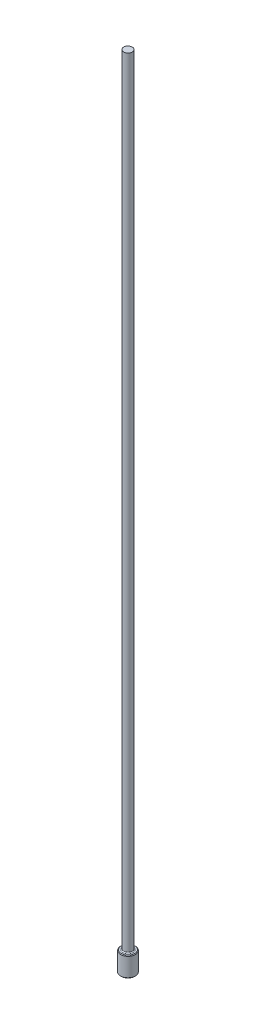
ISO-10303-21;
HEADER;
FILE_DESCRIPTION(('STEP AP214'),'2;1');
FILE_NAME('part.step','',(''),(''),'','','');
FILE_SCHEMA(('AUTOMOTIVE_DESIGN { 1 0 10303 214 1 1 1 1 }'));
ENDSEC;
DATA;
#1=APPLICATION_CONTEXT('core data for automotive mechanical design processes');
#2=APPLICATION_PROTOCOL_DEFINITION('international standard','automotive_design',2000,#1);
#3=PRODUCT_CONTEXT('',#1,'mechanical');
#4=PRODUCT('Part','Part','',(#3));
#5=PRODUCT_RELATED_PRODUCT_CATEGORY('part','',(#4));
#6=PRODUCT_DEFINITION_FORMATION('','',#4);
#7=PRODUCT_DEFINITION_CONTEXT('part definition',#1,'design');
#8=PRODUCT_DEFINITION('design','',#6,#7);
#9=PRODUCT_DEFINITION_SHAPE('','',#8);
#10=(LENGTH_UNIT() NAMED_UNIT(*) SI_UNIT(.MILLI.,.METRE.));
#11=(NAMED_UNIT(*) PLANE_ANGLE_UNIT() SI_UNIT($,.RADIAN.));
#12=(NAMED_UNIT(*) SI_UNIT($,.STERADIAN.) SOLID_ANGLE_UNIT());
#13=UNCERTAINTY_MEASURE_WITH_UNIT(LENGTH_MEASURE(1.E-05),#10,'distance_accuracy_value','');
#14=(GEOMETRIC_REPRESENTATION_CONTEXT(3) GLOBAL_UNCERTAINTY_ASSIGNED_CONTEXT((#13)) GLOBAL_UNIT_ASSIGNED_CONTEXT((#10,
#11,#12)) REPRESENTATION_CONTEXT('',''));
#15=CARTESIAN_POINT('',(0.,0.,0.));
#16=DIRECTION('',(0.,0.,1.));
#17=DIRECTION('',(1.,0.,0.));
#18=AXIS2_PLACEMENT_3D('',#15,#16,#17);
#19=CARTESIAN_POINT('',(0.,0.,0.));
#20=DIRECTION('',(0.,-1.,0.));
#21=DIRECTION('',(0.,0.,-1.));
#22=AXIS2_PLACEMENT_3D('',#19,#20,#21);
#23=PLANE('',#22);
#24=CARTESIAN_POINT('',(0.,0.,0.));
#25=DIRECTION('',(0.,-1.,0.));
#26=DIRECTION('',(0.,0.,-1.));
#27=AXIS2_PLACEMENT_3D('',#24,#25,#26);
#28=CIRCLE('',#27,0.533399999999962);
#29=CARTESIAN_POINT('',(0.,0.,-0.533399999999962));
#30=VERTEX_POINT('',#29);
#31=EDGE_CURVE('E46',#30,#30,#28,.T.);
#32=ORIENTED_EDGE('',*,*,#31,.T.);
#33=EDGE_LOOP('',(#32));
#34=FACE_BOUND('',#33,.T.);
#35=ADVANCED_FACE('F35',(#34),#23,.T.);
#36=CARTESIAN_POINT('',(0.,259.958771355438,0.));
#37=DIRECTION('',(0.,1.,0.));
#38=DIRECTION('',(0.,0.,1.));
#39=AXIS2_PLACEMENT_3D('',#36,#37,#38);
#40=CYLINDRICAL_SURFACE('',#39,0.584199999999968);
#41=CARTESIAN_POINT('',(0.,1.52399999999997,0.));
#42=DIRECTION('',(0.,1.,0.));
#43=DIRECTION('',(0.,0.,1.));
#44=AXIS2_PLACEMENT_3D('',#41,#42,#43);
#45=CIRCLE('',#44,0.584199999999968);
#46=CARTESIAN_POINT('',(0.,1.52399999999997,0.584199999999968));
#47=VERTEX_POINT('',#46);
#48=EDGE_CURVE('E50',#47,#47,#45,.F.);
#49=ORIENTED_EDGE('',*,*,#48,.T.);
#50=EDGE_LOOP('',(#49));
#51=FACE_BOUND('',#50,.T.);
#52=CARTESIAN_POINT('',(0.,0.0508000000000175,0.));
#53=DIRECTION('',(0.,-1.,0.));
#54=DIRECTION('',(0.,0.,-1.));
#55=AXIS2_PLACEMENT_3D('',#52,#53,#54);
#56=CIRCLE('',#55,0.584199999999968);
#57=CARTESIAN_POINT('',(0.,0.0508000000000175,-0.584199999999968));
#58=VERTEX_POINT('',#57);
#59=EDGE_CURVE('E55',#58,#58,#56,.F.);
#60=ORIENTED_EDGE('',*,*,#59,.T.);
#61=EDGE_LOOP('',(#60));
#62=FACE_BOUND('',#61,.T.);
#63=ADVANCED_FACE('F77',(#51,#62),#40,.T.);
#64=CARTESIAN_POINT('',(-0.584199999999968,1.5748,0.));
#65=DIRECTION('',(0.,1.,0.));
#66=DIRECTION('',(0.,0.,1.));
#67=AXIS2_PLACEMENT_3D('',#64,#65,#66);
#68=PLANE('',#67);
#69=CARTESIAN_POINT('',(0.,1.5748,0.));
#70=DIRECTION('',(0.,1.,0.));
#71=DIRECTION('',(0.,0.,1.));
#72=AXIS2_PLACEMENT_3D('',#69,#70,#71);
#73=CIRCLE('',#72,0.419099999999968);
#74=CARTESIAN_POINT('',(0.,1.5748,0.419099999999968));
#75=VERTEX_POINT('',#74);
#76=EDGE_CURVE('E10',#75,#75,#73,.F.);
#77=ORIENTED_EDGE('',*,*,#76,.T.);
#78=EDGE_LOOP('',(#77));
#79=FACE_BOUND('',#78,.T.);
#80=CARTESIAN_POINT('',(0.,1.5748,0.));
#81=DIRECTION('',(0.,1.,0.));
#82=DIRECTION('',(0.,0.,1.));
#83=AXIS2_PLACEMENT_3D('',#80,#81,#82);
#84=CIRCLE('',#83,0.533399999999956);
#85=CARTESIAN_POINT('',(0.,1.5748,0.533399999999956));
#86=VERTEX_POINT('',#85);
#87=EDGE_CURVE('E58',#86,#86,#84,.T.);
#88=ORIENTED_EDGE('',*,*,#87,.T.);
#89=EDGE_LOOP('',(#88));
#90=FACE_BOUND('',#89,.T.);
#91=ADVANCED_FACE('F69',(#79,#90),#68,.T.);
#92=CARTESIAN_POINT('',(0.,259.958771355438,0.));
#93=DIRECTION('',(0.,1.,0.));
#94=DIRECTION('',(0.,0.,1.));
#95=AXIS2_PLACEMENT_3D('',#92,#93,#94);
#96=CYLINDRICAL_SURFACE('',#95,0.342899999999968);
#97=CARTESIAN_POINT('',(0.,1.65100000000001,0.));
#98=DIRECTION('',(0.,1.,0.));
#99=DIRECTION('',(0.,0.,1.));
#100=AXIS2_PLACEMENT_3D('',#97,#98,#99);
#101=CIRCLE('',#100,0.342899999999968);
#102=CARTESIAN_POINT('',(0.,1.65100000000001,0.342899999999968));
#103=VERTEX_POINT('',#102);
#104=EDGE_CURVE('E42',#103,#103,#101,.T.);
#105=ORIENTED_EDGE('',*,*,#104,.T.);
#106=EDGE_LOOP('',(#105));
#107=FACE_BOUND('',#106,.T.);
#108=CARTESIAN_POINT('',(0.,63.5,0.));
#109=DIRECTION('',(0.,1.,0.));
#110=DIRECTION('',(0.,0.,1.));
#111=AXIS2_PLACEMENT_3D('',#108,#109,#110);
#112=CIRCLE('',#111,0.342899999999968);
#113=CARTESIAN_POINT('',(0.,63.5,0.342899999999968));
#114=VERTEX_POINT('',#113);
#115=EDGE_CURVE('E61',#114,#114,#112,.T.);
#116=ORIENTED_EDGE('',*,*,#115,.F.);
#117=EDGE_LOOP('',(#116));
#118=FACE_BOUND('',#117,.T.);
#119=ADVANCED_FACE('F67',(#107,#118),#96,.T.);
#120=CARTESIAN_POINT('',(-0.342899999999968,63.5,0.));
#121=DIRECTION('',(0.,1.,0.));
#122=DIRECTION('',(0.,0.,1.));
#123=AXIS2_PLACEMENT_3D('',#120,#121,#122);
#124=PLANE('',#123);
#125=ORIENTED_EDGE('',*,*,#115,.T.);
#126=EDGE_LOOP('',(#125));
#127=FACE_BOUND('',#126,.T.);
#128=ADVANCED_FACE('F65',(#127),#124,.T.);
#129=CARTESIAN_POINT('',(0.,1.57479999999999,0.));
#130=DIRECTION('',(0.,-1.,0.));
#131=DIRECTION('',(0.,0.,-1.));
#132=AXIS2_PLACEMENT_3D('',#129,#130,#131);
#133=CONICAL_SURFACE('',#132,0.533399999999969,0.785398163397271);
#134=ORIENTED_EDGE('',*,*,#48,.F.);
#135=EDGE_LOOP('',(#134));
#136=FACE_BOUND('',#135,.T.);
#137=ORIENTED_EDGE('',*,*,#87,.F.);
#138=EDGE_LOOP('',(#137));
#139=FACE_BOUND('',#138,.T.);
#140=ADVANCED_FACE('F75',(#136,#139),#133,.T.);
#141=CARTESIAN_POINT('',(0.,0.0508000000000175,0.));
#142=DIRECTION('',(0.,1.,0.));
#143=DIRECTION('',(0.,0.,1.));
#144=AXIS2_PLACEMENT_3D('',#141,#142,#143);
#145=CONICAL_SURFACE('',#144,0.584199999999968,0.785398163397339);
#146=ORIENTED_EDGE('',*,*,#31,.F.);
#147=EDGE_LOOP('',(#146));
#148=FACE_BOUND('',#147,.T.);
#149=ORIENTED_EDGE('',*,*,#59,.F.);
#150=EDGE_LOOP('',(#149));
#151=FACE_BOUND('',#150,.T.);
#152=ADVANCED_FACE('F89',(#148,#151),#145,.T.);
#153=CARTESIAN_POINT('',(0.,1.65100000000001,0.));
#154=DIRECTION('',(0.,1.,0.));
#155=DIRECTION('',(0.,0.,1.));
#156=AXIS2_PLACEMENT_3D('',#153,#154,#155);
#157=TOROIDAL_SURFACE('',#156,0.419099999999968,0.0762);
#158=ORIENTED_EDGE('',*,*,#76,.F.);
#159=EDGE_LOOP('',(#158));
#160=FACE_BOUND('',#159,.T.);
#161=ORIENTED_EDGE('',*,*,#104,.F.);
#162=EDGE_LOOP('',(#161));
#163=FACE_BOUND('',#162,.T.);
#164=ADVANCED_FACE('F37',(#160,#163),#157,.F.);
#165=CLOSED_SHELL('',(#35,#63,#91,#119,#128,#140,#152,#164));
#166=MANIFOLD_SOLID_BREP('B2',#165);
#167=ADVANCED_BREP_SHAPE_REPRESENTATION('',(#18,#166),#14);
#168=SHAPE_DEFINITION_REPRESENTATION(#9,#167);
ENDSEC;
END-ISO-10303-21;
